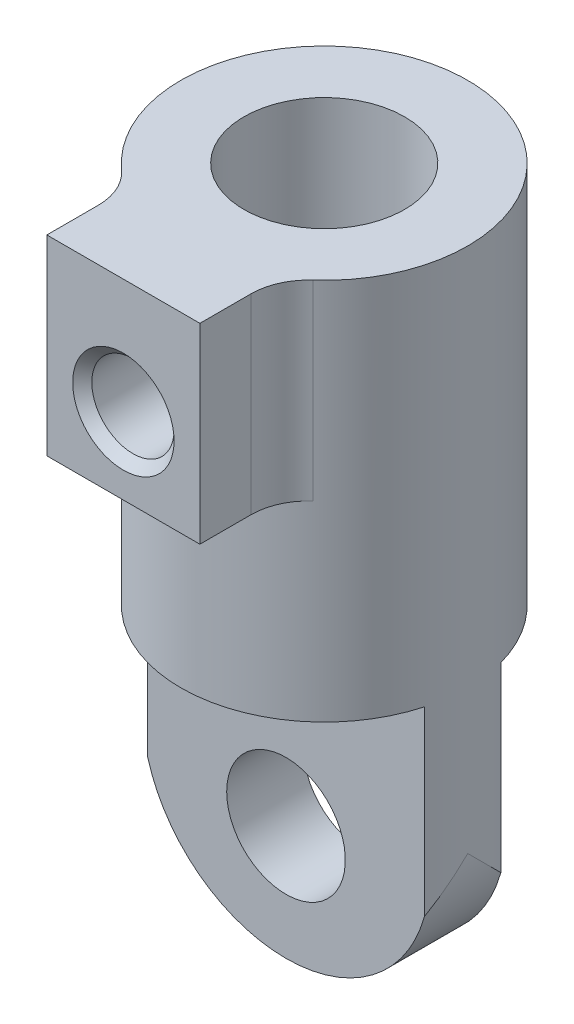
ISO-10303-21;
HEADER;
FILE_DESCRIPTION(('STEP AP214'),'2;1');
FILE_NAME('part.step','',(''),(''),'','','');
FILE_SCHEMA(('AUTOMOTIVE_DESIGN { 1 0 10303 214 1 1 1 1 }'));
ENDSEC;
DATA;
#1=APPLICATION_CONTEXT('core data for automotive mechanical design processes');
#2=APPLICATION_PROTOCOL_DEFINITION('international standard','automotive_design',2000,#1);
#3=PRODUCT_CONTEXT('',#1,'mechanical');
#4=PRODUCT('Part','Part','',(#3));
#5=PRODUCT_RELATED_PRODUCT_CATEGORY('part','',(#4));
#6=PRODUCT_DEFINITION_FORMATION('','',#4);
#7=PRODUCT_DEFINITION_CONTEXT('part definition',#1,'design');
#8=PRODUCT_DEFINITION('design','',#6,#7);
#9=PRODUCT_DEFINITION_SHAPE('','',#8);
#10=(LENGTH_UNIT() NAMED_UNIT(*) SI_UNIT(.MILLI.,.METRE.));
#11=(NAMED_UNIT(*) PLANE_ANGLE_UNIT() SI_UNIT($,.RADIAN.));
#12=(NAMED_UNIT(*) SI_UNIT($,.STERADIAN.) SOLID_ANGLE_UNIT());
#13=UNCERTAINTY_MEASURE_WITH_UNIT(LENGTH_MEASURE(1.E-05),#10,'distance_accuracy_value','');
#14=(GEOMETRIC_REPRESENTATION_CONTEXT(3) GLOBAL_UNCERTAINTY_ASSIGNED_CONTEXT((#13)) GLOBAL_UNIT_ASSIGNED_CONTEXT((#10,
#11,#12)) REPRESENTATION_CONTEXT('',''));
#15=CARTESIAN_POINT('',(0.,0.,0.));
#16=DIRECTION('',(0.,0.,1.));
#17=DIRECTION('',(1.,0.,0.));
#18=AXIS2_PLACEMENT_3D('',#15,#16,#17);
#19=CARTESIAN_POINT('',(0.,19.6,0.));
#20=DIRECTION('',(0.,1.,0.));
#21=DIRECTION('',(0.,0.,1.));
#22=AXIS2_PLACEMENT_3D('',#19,#20,#21);
#23=PLANE('',#22);
#24=DIRECTION('',(1.,0.,0.));
#25=VECTOR('',#24,1.);
#26=CARTESIAN_POINT('',(-2.,19.6,0.));
#27=LINE('',#26,#25);
#28=CARTESIAN_POINT('',(-1.99999999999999,19.6,0.));
#29=VERTEX_POINT('',#28);
#30=CARTESIAN_POINT('',(0.4344315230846,19.6,0.));
#31=VERTEX_POINT('',#30);
#32=EDGE_CURVE('E408',#29,#31,#27,.T.);
#33=ORIENTED_EDGE('',*,*,#32,.T.);
#34=DIRECTION('',(0.258819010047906,0.,-0.965925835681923));
#35=VECTOR('',#34,1.);
#36=CARTESIAN_POINT('',(0.4344315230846,19.6,0.));
#37=LINE('',#36,#35);
#38=CARTESIAN_POINT('',(0.539492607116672,19.6,-0.392093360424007));
#39=VERTEX_POINT('',#38);
#40=EDGE_CURVE('E403',#31,#39,#37,.T.);
#41=ORIENTED_EDGE('',*,*,#40,.T.);
#42=DIRECTION('',(-1.,0.,0.));
#43=VECTOR('',#42,1.);
#44=CARTESIAN_POINT('',(0.5394926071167,19.6,-0.392093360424));
#45=LINE('',#44,#43);
#46=CARTESIAN_POINT('',(-1.489200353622,19.6,-0.392093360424));
#47=VERTEX_POINT('',#46);
#48=EDGE_CURVE('E398',#39,#47,#45,.T.);
#49=ORIENTED_EDGE('',*,*,#48,.T.);
#50=DIRECTION('',(0.2588190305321,0.,-0.965925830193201));
#51=VECTOR('',#50,1.);
#52=CARTESIAN_POINT('',(-1.489200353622,19.6,-0.392093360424));
#53=LINE('',#52,#51);
#54=CARTESIAN_POINT('',(-1.2090374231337,19.6,-1.43767571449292));
#55=VERTEX_POINT('',#54);
#56=EDGE_CURVE('E453',#47,#55,#53,.T.);
#57=ORIENTED_EDGE('',*,*,#56,.T.);
#58=DIRECTION('',(1.,0.,0.));
#59=VECTOR('',#58,1.);
#60=CARTESIAN_POINT('',(-1.209037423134,19.6,-1.437675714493));
#61=LINE('',#60,#59);
#62=CARTESIAN_POINT('',(0.5491631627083,19.6,-1.437675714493));
#63=VERTEX_POINT('',#62);
#64=EDGE_CURVE('E448',#55,#63,#61,.T.);
#65=ORIENTED_EDGE('',*,*,#64,.T.);
#66=DIRECTION('',(0.258819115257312,0.,-0.965925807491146));
#67=VECTOR('',#66,1.);
#68=CARTESIAN_POINT('',(0.5491631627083,19.6,-1.437675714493));
#69=LINE('',#68,#67);
#70=CARTESIAN_POINT('',(0.654224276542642,19.6,-1.82976901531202));
#71=VERTEX_POINT('',#70);
#72=EDGE_CURVE('E443',#63,#71,#69,.T.);
#73=ORIENTED_EDGE('',*,*,#72,.T.);
#74=DIRECTION('',(-1.,0.,0.));
#75=VECTOR('',#74,1.);
#76=CARTESIAN_POINT('',(0.6542242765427,19.6,-1.829769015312));
#77=LINE('',#76,#75);
#78=CARTESIAN_POINT('',(-1.103976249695,19.6,-1.829769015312));
#79=VERTEX_POINT('',#78);
#80=EDGE_CURVE('E438',#71,#79,#77,.T.);
#81=ORIENTED_EDGE('',*,*,#80,.T.);
#82=DIRECTION('',(0.258819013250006,0.,-0.965925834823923));
#83=VECTOR('',#82,1.);
#84=CARTESIAN_POINT('',(-1.103976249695,19.6,-1.829769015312));
#85=LINE('',#84,#83);
#86=CARTESIAN_POINT('',(-0.876343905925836,19.6,-2.67930459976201));
#87=VERTEX_POINT('',#86);
#88=EDGE_CURVE('E433',#79,#87,#85,.T.);
#89=ORIENTED_EDGE('',*,*,#88,.T.);
#90=DIRECTION('',(1.,0.,0.));
#91=VECTOR('',#90,1.);
#92=CARTESIAN_POINT('',(-0.8763439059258,19.6,-2.679304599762));
#93=LINE('',#92,#91);
#94=CARTESIAN_POINT('',(1.152348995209,19.6,-2.679304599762));
#95=VERTEX_POINT('',#94);
#96=EDGE_CURVE('E428',#87,#95,#93,.T.);
#97=ORIENTED_EDGE('',*,*,#96,.T.);
#98=DIRECTION('',(0.258819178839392,0.,-0.965925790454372));
#99=VECTOR('',#98,1.);
#100=CARTESIAN_POINT('',(1.152348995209,19.6,-2.679304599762));
#101=LINE('',#100,#99);
#102=CARTESIAN_POINT('',(1.25741016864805,19.6,-3.07139801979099));
#103=VERTEX_POINT('',#102);
#104=EDGE_CURVE('E423',#95,#103,#101,.T.);
#105=ORIENTED_EDGE('',*,*,#104,.T.);
#106=DIRECTION('',(-1.,0.,0.));
#107=VECTOR('',#106,1.);
#108=CARTESIAN_POINT('',(1.257410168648,19.6,-3.071398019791));
#109=LINE('',#108,#107);
#110=CARTESIAN_POINT('',(-1.177021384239,19.6,-3.071398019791));
#111=VERTEX_POINT('',#110);
#112=EDGE_CURVE('E418',#103,#111,#109,.T.);
#113=ORIENTED_EDGE('',*,*,#112,.T.);
#114=DIRECTION('',(-0.258819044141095,0.,0.965925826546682));
#115=VECTOR('',#114,1.);
#116=CARTESIAN_POINT('',(-1.177021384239,19.6,-3.071398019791));
#117=LINE('',#116,#115);
#118=EDGE_CURVE('E413',#111,#29,#117,.T.);
#119=ORIENTED_EDGE('',*,*,#118,.T.);
#120=EDGE_LOOP('',(#33,#41,#49,#57,#65,#73,#81,#89,#97,#105,#113,#119));
#121=FACE_BOUND('',#120,.T.);
#122=ADVANCED_FACE('F16',(#121),#23,.T.);
#123=CARTESIAN_POINT('',(-1.489200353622,20.,-0.392093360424));
#124=DIRECTION('',(0.965925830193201,0.,0.2588190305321));
#125=DIRECTION('',(0.2588190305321,0.,-0.965925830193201));
#126=AXIS2_PLACEMENT_3D('',#123,#124,#125);
#127=PLANE('',#126);
#128=DIRECTION('',(0.,1.,0.));
#129=VECTOR('',#128,1.);
#130=CARTESIAN_POINT('',(-1.209037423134,20.,-1.437675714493));
#131=LINE('',#130,#129);
#132=CARTESIAN_POINT('',(-1.2090374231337,20.,-1.43767571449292));
#133=VERTEX_POINT('',#132);
#134=EDGE_CURVE('E450',#133,#55,#131,.F.);
#135=ORIENTED_EDGE('',*,*,#134,.T.);
#136=ORIENTED_EDGE('',*,*,#56,.F.);
#137=DIRECTION('',(0.,1.,0.));
#138=VECTOR('',#137,1.);
#139=CARTESIAN_POINT('',(-1.489200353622,20.,-0.392093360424));
#140=LINE('',#139,#138);
#141=CARTESIAN_POINT('',(-1.489200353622,20.,-0.392093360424));
#142=VERTEX_POINT('',#141);
#143=EDGE_CURVE('E396',#47,#142,#140,.T.);
#144=ORIENTED_EDGE('',*,*,#143,.T.);
#145=DIRECTION('',(0.258819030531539,0.,-0.965925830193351));
#146=VECTOR('',#145,1.);
#147=CARTESIAN_POINT('',(-1.489200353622,20.,-0.392093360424));
#148=LINE('',#147,#146);
#149=EDGE_CURVE('E394',#142,#133,#148,.T.);
#150=ORIENTED_EDGE('',*,*,#149,.T.);
#151=EDGE_LOOP('',(#135,#136,#144,#150));
#152=FACE_BOUND('',#151,.T.);
#153=ADVANCED_FACE('F461',(#152),#127,.F.);
#154=CARTESIAN_POINT('',(-1.209037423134,20.,-1.437675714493));
#155=DIRECTION('',(0.,0.,1.));
#156=DIRECTION('',(1.,0.,0.));
#157=AXIS2_PLACEMENT_3D('',#154,#155,#156);
#158=PLANE('',#157);
#159=DIRECTION('',(0.,1.,0.));
#160=VECTOR('',#159,1.);
#161=CARTESIAN_POINT('',(0.5491631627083,20.,-1.437675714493));
#162=LINE('',#161,#160);
#163=CARTESIAN_POINT('',(0.5491631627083,20.,-1.437675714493));
#164=VERTEX_POINT('',#163);
#165=EDGE_CURVE('E445',#164,#63,#162,.F.);
#166=ORIENTED_EDGE('',*,*,#165,.T.);
#167=ORIENTED_EDGE('',*,*,#64,.F.);
#168=ORIENTED_EDGE('',*,*,#134,.F.);
#169=DIRECTION('',(1.,0.,0.));
#170=VECTOR('',#169,1.);
#171=CARTESIAN_POINT('',(0.,20.,-1.437675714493));
#172=LINE('',#171,#170);
#173=EDGE_CURVE('E392',#133,#164,#172,.T.);
#174=ORIENTED_EDGE('',*,*,#173,.T.);
#175=EDGE_LOOP('',(#166,#167,#168,#174));
#176=FACE_BOUND('',#175,.T.);
#177=ADVANCED_FACE('F465',(#176),#158,.F.);
#178=CARTESIAN_POINT('',(0.5491631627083,20.,-1.437675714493));
#179=DIRECTION('',(0.965925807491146,0.,0.258819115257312));
#180=DIRECTION('',(0.258819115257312,0.,-0.965925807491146));
#181=AXIS2_PLACEMENT_3D('',#178,#179,#180);
#182=PLANE('',#181);
#183=DIRECTION('',(0.,1.,0.));
#184=VECTOR('',#183,1.);
#185=CARTESIAN_POINT('',(0.6542242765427,20.,-1.829769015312));
#186=LINE('',#185,#184);
#187=CARTESIAN_POINT('',(0.654224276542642,20.,-1.82976901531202));
#188=VERTEX_POINT('',#187);
#189=EDGE_CURVE('E440',#188,#71,#186,.F.);
#190=ORIENTED_EDGE('',*,*,#189,.T.);
#191=ORIENTED_EDGE('',*,*,#72,.F.);
#192=ORIENTED_EDGE('',*,*,#165,.F.);
#193=DIRECTION('',(0.258819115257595,0.,-0.96592580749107));
#194=VECTOR('',#193,1.);
#195=CARTESIAN_POINT('',(0.5491631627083,20.,-1.437675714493));
#196=LINE('',#195,#194);
#197=EDGE_CURVE('E390',#164,#188,#196,.T.);
#198=ORIENTED_EDGE('',*,*,#197,.T.);
#199=EDGE_LOOP('',(#190,#191,#192,#198));
#200=FACE_BOUND('',#199,.T.);
#201=ADVANCED_FACE('F470',(#200),#182,.F.);
#202=CARTESIAN_POINT('',(0.6542242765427,20.,-1.829769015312));
#203=DIRECTION('',(0.,0.,-1.));
#204=DIRECTION('',(-1.,0.,0.));
#205=AXIS2_PLACEMENT_3D('',#202,#203,#204);
#206=PLANE('',#205);
#207=DIRECTION('',(0.,1.,0.));
#208=VECTOR('',#207,1.);
#209=CARTESIAN_POINT('',(-1.103976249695,20.,-1.829769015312));
#210=LINE('',#209,#208);
#211=CARTESIAN_POINT('',(-1.103976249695,20.,-1.829769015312));
#212=VERTEX_POINT('',#211);
#213=EDGE_CURVE('E435',#212,#79,#210,.F.);
#214=ORIENTED_EDGE('',*,*,#213,.T.);
#215=ORIENTED_EDGE('',*,*,#80,.F.);
#216=ORIENTED_EDGE('',*,*,#189,.F.);
#217=DIRECTION('',(1.,0.,0.));
#218=VECTOR('',#217,1.);
#219=CARTESIAN_POINT('',(0.,20.,-1.829769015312));
#220=LINE('',#219,#218);
#221=EDGE_CURVE('E388',#188,#212,#220,.F.);
#222=ORIENTED_EDGE('',*,*,#221,.T.);
#223=EDGE_LOOP('',(#214,#215,#216,#222));
#224=FACE_BOUND('',#223,.T.);
#225=ADVANCED_FACE('F476',(#224),#206,.F.);
#226=CARTESIAN_POINT('',(-1.103976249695,20.,-1.829769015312));
#227=DIRECTION('',(0.965925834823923,0.,0.258819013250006));
#228=DIRECTION('',(0.258819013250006,0.,-0.965925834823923));
#229=AXIS2_PLACEMENT_3D('',#226,#227,#228);
#230=PLANE('',#229);
#231=DIRECTION('',(0.,1.,0.));
#232=VECTOR('',#231,1.);
#233=CARTESIAN_POINT('',(-0.8763439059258,20.,-2.679304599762));
#234=LINE('',#233,#232);
#235=CARTESIAN_POINT('',(-0.876343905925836,20.,-2.67930459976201));
#236=VERTEX_POINT('',#235);
#237=EDGE_CURVE('E430',#236,#87,#234,.F.);
#238=ORIENTED_EDGE('',*,*,#237,.T.);
#239=ORIENTED_EDGE('',*,*,#88,.F.);
#240=ORIENTED_EDGE('',*,*,#213,.F.);
#241=DIRECTION('',(0.258819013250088,0.,-0.965925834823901));
#242=VECTOR('',#241,1.);
#243=CARTESIAN_POINT('',(-1.103976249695,20.,-1.829769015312));
#244=LINE('',#243,#242);
#245=EDGE_CURVE('E386',#212,#236,#244,.T.);
#246=ORIENTED_EDGE('',*,*,#245,.T.);
#247=EDGE_LOOP('',(#238,#239,#240,#246));
#248=FACE_BOUND('',#247,.T.);
#249=ADVANCED_FACE('F480',(#248),#230,.F.);
#250=CARTESIAN_POINT('',(-0.8763439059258,20.,-2.679304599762));
#251=DIRECTION('',(0.,0.,1.));
#252=DIRECTION('',(1.,0.,0.));
#253=AXIS2_PLACEMENT_3D('',#250,#251,#252);
#254=PLANE('',#253);
#255=DIRECTION('',(0.,1.,0.));
#256=VECTOR('',#255,1.);
#257=CARTESIAN_POINT('',(1.152348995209,20.,-2.679304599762));
#258=LINE('',#257,#256);
#259=CARTESIAN_POINT('',(1.152348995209,20.,-2.679304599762));
#260=VERTEX_POINT('',#259);
#261=EDGE_CURVE('E425',#260,#95,#258,.F.);
#262=ORIENTED_EDGE('',*,*,#261,.T.);
#263=ORIENTED_EDGE('',*,*,#96,.F.);
#264=ORIENTED_EDGE('',*,*,#237,.F.);
#265=DIRECTION('',(1.,0.,0.));
#266=VECTOR('',#265,1.);
#267=CARTESIAN_POINT('',(0.,20.,-2.679304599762));
#268=LINE('',#267,#266);
#269=EDGE_CURVE('E384',#236,#260,#268,.T.);
#270=ORIENTED_EDGE('',*,*,#269,.T.);
#271=EDGE_LOOP('',(#262,#263,#264,#270));
#272=FACE_BOUND('',#271,.T.);
#273=ADVANCED_FACE('F485',(#272),#254,.F.);
#274=CARTESIAN_POINT('',(1.152348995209,20.,-2.679304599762));
#275=DIRECTION('',(0.965925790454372,0.,0.258819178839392));
#276=DIRECTION('',(0.258819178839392,0.,-0.965925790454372));
#277=AXIS2_PLACEMENT_3D('',#274,#275,#276);
#278=PLANE('',#277);
#279=DIRECTION('',(0.,1.,0.));
#280=VECTOR('',#279,1.);
#281=CARTESIAN_POINT('',(1.257410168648,20.,-3.071398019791));
#282=LINE('',#281,#280);
#283=CARTESIAN_POINT('',(1.25741016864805,20.,-3.07139801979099));
#284=VERTEX_POINT('',#283);
#285=EDGE_CURVE('E420',#284,#103,#282,.F.);
#286=ORIENTED_EDGE('',*,*,#285,.T.);
#287=ORIENTED_EDGE('',*,*,#104,.F.);
#288=ORIENTED_EDGE('',*,*,#261,.F.);
#289=DIRECTION('',(0.258819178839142,0.,-0.965925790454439));
#290=VECTOR('',#289,1.);
#291=CARTESIAN_POINT('',(1.152348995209,20.,-2.679304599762));
#292=LINE('',#291,#290);
#293=EDGE_CURVE('E382',#260,#284,#292,.T.);
#294=ORIENTED_EDGE('',*,*,#293,.T.);
#295=EDGE_LOOP('',(#286,#287,#288,#294));
#296=FACE_BOUND('',#295,.T.);
#297=ADVANCED_FACE('F491',(#296),#278,.F.);
#298=CARTESIAN_POINT('',(1.257410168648,20.,-3.071398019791));
#299=DIRECTION('',(0.,0.,-1.));
#300=DIRECTION('',(-1.,0.,0.));
#301=AXIS2_PLACEMENT_3D('',#298,#299,#300);
#302=PLANE('',#301);
#303=DIRECTION('',(0.,1.,0.));
#304=VECTOR('',#303,1.);
#305=CARTESIAN_POINT('',(-1.177021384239,20.,-3.071398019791));
#306=LINE('',#305,#304);
#307=CARTESIAN_POINT('',(-1.177021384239,20.,-3.071398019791));
#308=VERTEX_POINT('',#307);
#309=EDGE_CURVE('E415',#308,#111,#306,.F.);
#310=ORIENTED_EDGE('',*,*,#309,.T.);
#311=ORIENTED_EDGE('',*,*,#112,.F.);
#312=ORIENTED_EDGE('',*,*,#285,.F.);
#313=DIRECTION('',(1.,0.,0.));
#314=VECTOR('',#313,1.);
#315=CARTESIAN_POINT('',(0.,20.,-3.071398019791));
#316=LINE('',#315,#314);
#317=EDGE_CURVE('E380',#284,#308,#316,.F.);
#318=ORIENTED_EDGE('',*,*,#317,.T.);
#319=EDGE_LOOP('',(#310,#311,#312,#318));
#320=FACE_BOUND('',#319,.T.);
#321=ADVANCED_FACE('F495',(#320),#302,.F.);
#322=CARTESIAN_POINT('',(-1.177021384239,20.,-3.071398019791));
#323=DIRECTION('',(-0.965925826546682,0.,-0.258819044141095));
#324=DIRECTION('',(-0.258819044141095,0.,0.965925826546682));
#325=AXIS2_PLACEMENT_3D('',#322,#323,#324);
#326=PLANE('',#325);
#327=DIRECTION('',(0.,1.,0.));
#328=VECTOR('',#327,1.);
#329=CARTESIAN_POINT('',(-2.,20.,0.));
#330=LINE('',#329,#328);
#331=CARTESIAN_POINT('',(-1.99999999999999,20.,0.));
#332=VERTEX_POINT('',#331);
#333=EDGE_CURVE('E410',#332,#29,#330,.F.);
#334=ORIENTED_EDGE('',*,*,#333,.T.);
#335=ORIENTED_EDGE('',*,*,#118,.F.);
#336=ORIENTED_EDGE('',*,*,#309,.F.);
#337=DIRECTION('',(-0.258819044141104,0.,0.965925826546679));
#338=VECTOR('',#337,1.);
#339=CARTESIAN_POINT('',(-1.177021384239,20.,-3.071398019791));
#340=LINE('',#339,#338);
#341=EDGE_CURVE('E378',#308,#332,#340,.T.);
#342=ORIENTED_EDGE('',*,*,#341,.T.);
#343=EDGE_LOOP('',(#334,#335,#336,#342));
#344=FACE_BOUND('',#343,.T.);
#345=ADVANCED_FACE('F500',(#344),#326,.F.);
#346=CARTESIAN_POINT('',(-2.,20.,0.));
#347=DIRECTION('',(0.,0.,1.));
#348=DIRECTION('',(1.,0.,0.));
#349=AXIS2_PLACEMENT_3D('',#346,#347,#348);
#350=PLANE('',#349);
#351=DIRECTION('',(0.,1.,0.));
#352=VECTOR('',#351,1.);
#353=CARTESIAN_POINT('',(0.4344315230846,20.,0.));
#354=LINE('',#353,#352);
#355=CARTESIAN_POINT('',(0.4344315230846,20.,0.));
#356=VERTEX_POINT('',#355);
#357=EDGE_CURVE('E405',#356,#31,#354,.F.);
#358=ORIENTED_EDGE('',*,*,#357,.T.);
#359=ORIENTED_EDGE('',*,*,#32,.F.);
#360=ORIENTED_EDGE('',*,*,#333,.F.);
#361=DIRECTION('',(1.,0.,0.));
#362=VECTOR('',#361,1.);
#363=CARTESIAN_POINT('',(0.,20.,0.));
#364=LINE('',#363,#362);
#365=EDGE_CURVE('E376',#332,#356,#364,.T.);
#366=ORIENTED_EDGE('',*,*,#365,.T.);
#367=EDGE_LOOP('',(#358,#359,#360,#366));
#368=FACE_BOUND('',#367,.T.);
#369=ADVANCED_FACE('F506',(#368),#350,.F.);
#370=CARTESIAN_POINT('',(0.4344315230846,20.,0.));
#371=DIRECTION('',(0.965925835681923,0.,0.258819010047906));
#372=DIRECTION('',(0.258819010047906,0.,-0.965925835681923));
#373=AXIS2_PLACEMENT_3D('',#370,#371,#372);
#374=PLANE('',#373);
#375=DIRECTION('',(0.,1.,0.));
#376=VECTOR('',#375,1.);
#377=CARTESIAN_POINT('',(0.5394926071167,20.,-0.392093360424));
#378=LINE('',#377,#376);
#379=CARTESIAN_POINT('',(0.539492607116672,20.,-0.392093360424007));
#380=VERTEX_POINT('',#379);
#381=EDGE_CURVE('E400',#380,#39,#378,.F.);
#382=ORIENTED_EDGE('',*,*,#381,.T.);
#383=ORIENTED_EDGE('',*,*,#40,.F.);
#384=ORIENTED_EDGE('',*,*,#357,.F.);
#385=DIRECTION('',(0.258819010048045,0.,-0.965925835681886));
#386=VECTOR('',#385,1.);
#387=CARTESIAN_POINT('',(0.4344315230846,20.,0.));
#388=LINE('',#387,#386);
#389=EDGE_CURVE('E374',#356,#380,#388,.T.);
#390=ORIENTED_EDGE('',*,*,#389,.T.);
#391=EDGE_LOOP('',(#382,#383,#384,#390));
#392=FACE_BOUND('',#391,.T.);
#393=ADVANCED_FACE('F510',(#392),#374,.F.);
#394=CARTESIAN_POINT('',(0.5394926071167,20.,-0.392093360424));
#395=DIRECTION('',(0.,0.,-1.));
#396=DIRECTION('',(-1.,0.,0.));
#397=AXIS2_PLACEMENT_3D('',#394,#395,#396);
#398=PLANE('',#397);
#399=ORIENTED_EDGE('',*,*,#143,.F.);
#400=ORIENTED_EDGE('',*,*,#48,.F.);
#401=ORIENTED_EDGE('',*,*,#381,.F.);
#402=DIRECTION('',(1.,0.,0.));
#403=VECTOR('',#402,1.);
#404=CARTESIAN_POINT('',(0.,20.,-0.392093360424));
#405=LINE('',#404,#403);
#406=EDGE_CURVE('E369',#380,#142,#405,.F.);
#407=ORIENTED_EDGE('',*,*,#406,.T.);
#408=EDGE_LOOP('',(#399,#400,#401,#407));
#409=FACE_BOUND('',#408,.T.);
#410=ADVANCED_FACE('F514',(#409),#398,.F.);
#411=CARTESIAN_POINT('',(0.,20.,0.));
#412=DIRECTION('',(0.,-1.,0.));
#413=DIRECTION('',(0.,0.,-1.));
#414=AXIS2_PLACEMENT_3D('',#411,#412,#413);
#415=PLANE('',#414);
#416=ORIENTED_EDGE('',*,*,#389,.F.);
#417=ORIENTED_EDGE('',*,*,#365,.F.);
#418=ORIENTED_EDGE('',*,*,#341,.F.);
#419=ORIENTED_EDGE('',*,*,#317,.F.);
#420=ORIENTED_EDGE('',*,*,#293,.F.);
#421=ORIENTED_EDGE('',*,*,#269,.F.);
#422=ORIENTED_EDGE('',*,*,#245,.F.);
#423=ORIENTED_EDGE('',*,*,#221,.F.);
#424=ORIENTED_EDGE('',*,*,#197,.F.);
#425=ORIENTED_EDGE('',*,*,#173,.F.);
#426=ORIENTED_EDGE('',*,*,#149,.F.);
#427=ORIENTED_EDGE('',*,*,#406,.F.);
#428=EDGE_LOOP('',(#416,#417,#418,#419,#420,#421,#422,#423,#424,#425,#426,#427));
#429=FACE_BOUND('',#428,.T.);
#430=CARTESIAN_POINT('',(0.,20.,0.));
#431=DIRECTION('',(0.,-1.,0.));
#432=DIRECTION('',(0.,0.,-1.));
#433=AXIS2_PLACEMENT_3D('',#430,#431,#432);
#434=CIRCLE('',#433,4.2);
#435=CARTESIAN_POINT('',(0.,20.,-4.2));
#436=VERTEX_POINT('',#435);
#437=EDGE_CURVE('E19',#436,#436,#434,.F.);
#438=ORIENTED_EDGE('',*,*,#437,.T.);
#439=EDGE_LOOP('',(#438));
#440=FACE_BOUND('',#439,.T.);
#441=ADVANCED_FACE('F225',(#429,#440),#415,.F.);
#442=CARTESIAN_POINT('',(0.,29.,10.5));
#443=DIRECTION('',(0.,0.,-1.));
#444=DIRECTION('',(-1.,0.,0.));
#445=AXIS2_PLACEMENT_3D('',#442,#443,#444);
#446=CYLINDRICAL_SURFACE('',#445,2.15);
#447=CARTESIAN_POINT('',(0.,29.,9.99999999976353));
#448=DIRECTION('',(0.,0.,1.));
#449=DIRECTION('',(1.,0.,0.));
#450=AXIS2_PLACEMENT_3D('',#447,#448,#449);
#451=CIRCLE('',#450,2.15000000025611);
#452=CARTESIAN_POINT('',(2.15000000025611,29.,9.99999999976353));
#453=VERTEX_POINT('',#452);
#454=EDGE_CURVE('E366',#453,#453,#451,.T.);
#455=ORIENTED_EDGE('',*,*,#454,.T.);
#456=EDGE_LOOP('',(#455));
#457=FACE_BOUND('',#456,.T.);
#458=CARTESIAN_POINT('',(-2.15,29.,3.60797727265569));
#459=CARTESIAN_POINT('',(-2.14999364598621,29.1116960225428,3.60798558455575));
#460=CARTESIAN_POINT('',(-2.14124392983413,29.2234528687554,3.61323942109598));
#461=CARTESIAN_POINT('',(-2.10672513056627,29.4434496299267,3.63346733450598));
#462=CARTESIAN_POINT('',(-2.08093536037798,29.5516851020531,3.64845322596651));
#463=CARTESIAN_POINT('',(-2.01376236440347,29.761117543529,3.6859486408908));
#464=CARTESIAN_POINT('',(-1.97246030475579,29.8623479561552,3.70841893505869));
#465=CARTESIAN_POINT('',(-1.87569159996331,30.0564347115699,3.75828896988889));
#466=CARTESIAN_POINT('',(-1.82022129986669,30.1492888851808,3.78568998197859));
#467=CARTESIAN_POINT('',(-1.69106411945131,30.3328394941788,3.8452279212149));
#468=CARTESIAN_POINT('',(-1.61621555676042,30.4226524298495,3.87756948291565));
#469=CARTESIAN_POINT('',(-1.45284016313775,30.5891405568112,3.94169499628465));
#470=CARTESIAN_POINT('',(-1.36430666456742,30.6658093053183,3.97347866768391));
#471=CARTESIAN_POINT('',(-1.16834231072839,30.8092097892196,4.03562472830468));
#472=CARTESIAN_POINT('',(-1.06001282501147,30.8748388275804,4.06572293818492));
#473=CARTESIAN_POINT('',(-0.832020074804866,30.9865354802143,4.11842097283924));
#474=CARTESIAN_POINT('',(-0.712364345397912,31.0326159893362,4.1410257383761));
#475=CARTESIAN_POINT('',(-0.474495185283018,31.1003556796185,4.17470930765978));
#476=CARTESIAN_POINT('',(-0.356830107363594,31.123569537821,4.18651717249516));
#477=CARTESIAN_POINT('',(-0.11872955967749,31.1500522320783,4.20001029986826));
#478=CARTESIAN_POINT('',(0.00170410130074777,31.1533337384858,4.20170199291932));
#479=CARTESIAN_POINT('',(0.230170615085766,31.1404233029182,4.19510376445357));
#480=CARTESIAN_POINT('',(0.338334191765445,31.1259771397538,4.18770860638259));
#481=CARTESIAN_POINT('',(0.550450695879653,31.081166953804,4.16513889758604));
#482=CARTESIAN_POINT('',(0.654403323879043,31.050801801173,4.14996379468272));
#483=CARTESIAN_POINT('',(0.85690739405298,30.9748586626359,4.11296196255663));
#484=CARTESIAN_POINT('',(0.955368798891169,30.9290840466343,4.09104959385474));
#485=CARTESIAN_POINT('',(1.14344077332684,30.8239145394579,4.04252270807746));
#486=CARTESIAN_POINT('',(1.23304833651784,30.7645150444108,4.01590660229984));
#487=CARTESIAN_POINT('',(1.41022162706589,30.6271266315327,3.95737371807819));
#488=CARTESIAN_POINT('',(1.49673187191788,30.5478882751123,3.92519311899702));
#489=CARTESIAN_POINT('',(1.65583481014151,30.3763763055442,3.86077652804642));
#490=CARTESIAN_POINT('',(1.72841356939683,30.2840898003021,3.82854051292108));
#491=CARTESIAN_POINT('',(1.86253088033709,30.0813244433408,3.765216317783));
#492=CARTESIAN_POINT('',(1.92295317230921,29.9700273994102,3.73436319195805));
#493=CARTESIAN_POINT('',(2.02370237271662,29.7369905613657,3.68075041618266));
#494=CARTESIAN_POINT('',(2.06407333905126,29.6152743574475,3.65797305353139));
#495=CARTESIAN_POINT('',(2.11206482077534,29.4103974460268,3.63037632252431));
#496=CARTESIAN_POINT('',(2.12624856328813,29.3292010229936,3.62204185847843));
#497=CARTESIAN_POINT('',(2.14521745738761,29.1653472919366,3.61083986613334));
#498=CARTESIAN_POINT('',(2.15000470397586,29.0826903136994,3.60797111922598));
#499=CARTESIAN_POINT('',(2.14999364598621,28.8883039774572,3.60798558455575));
#500=CARTESIAN_POINT('',(2.14124392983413,28.7765471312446,3.61323942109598));
#501=CARTESIAN_POINT('',(2.10672513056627,28.5565503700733,3.63346733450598));
#502=CARTESIAN_POINT('',(2.08093536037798,28.4483148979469,3.64845322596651));
#503=CARTESIAN_POINT('',(2.01376236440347,28.238882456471,3.6859486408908));
#504=CARTESIAN_POINT('',(1.97246030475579,28.1376520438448,3.70841893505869));
#505=CARTESIAN_POINT('',(1.87569159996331,27.9435652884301,3.7582889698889));
#506=CARTESIAN_POINT('',(1.82022129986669,27.8507111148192,3.78568998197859));
#507=CARTESIAN_POINT('',(1.69106411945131,27.6671605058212,3.8452279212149));
#508=CARTESIAN_POINT('',(1.61621555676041,27.5773475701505,3.87756948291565));
#509=CARTESIAN_POINT('',(1.45284016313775,27.4108594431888,3.94169499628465));
#510=CARTESIAN_POINT('',(1.36430666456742,27.3341906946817,3.97347866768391));
#511=CARTESIAN_POINT('',(1.16834231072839,27.1907902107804,4.03562472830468));
#512=CARTESIAN_POINT('',(1.06001282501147,27.1251611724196,4.06572293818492));
#513=CARTESIAN_POINT('',(0.832020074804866,27.0134645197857,4.11842097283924));
#514=CARTESIAN_POINT('',(0.712364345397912,26.9673840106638,4.1410257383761));
#515=CARTESIAN_POINT('',(0.474495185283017,26.8996443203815,4.17470930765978));
#516=CARTESIAN_POINT('',(0.356830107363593,26.876430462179,4.18651717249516));
#517=CARTESIAN_POINT('',(0.11872955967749,26.8499477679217,4.20001029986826));
#518=CARTESIAN_POINT('',(-0.0017041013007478,26.8466662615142,4.20170199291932));
#519=CARTESIAN_POINT('',(-0.230170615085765,26.8595766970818,4.19510376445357));
#520=CARTESIAN_POINT('',(-0.338334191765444,26.8740228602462,4.18770860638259));
#521=CARTESIAN_POINT('',(-0.550450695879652,26.918833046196,4.16513889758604));
#522=CARTESIAN_POINT('',(-0.654403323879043,26.9491981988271,4.14996379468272));
#523=CARTESIAN_POINT('',(-0.85690739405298,27.0251413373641,4.11296196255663));
#524=CARTESIAN_POINT('',(-0.955368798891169,27.0709159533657,4.09104959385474));
#525=CARTESIAN_POINT('',(-1.14344077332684,27.1760854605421,4.04252270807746));
#526=CARTESIAN_POINT('',(-1.23304833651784,27.2354849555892,4.01590660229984));
#527=CARTESIAN_POINT('',(-1.41022162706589,27.3728733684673,3.95737371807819));
#528=CARTESIAN_POINT('',(-1.49673187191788,27.4521117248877,3.92519311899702));
#529=CARTESIAN_POINT('',(-1.65583481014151,27.6236236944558,3.86077652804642));
#530=CARTESIAN_POINT('',(-1.72841356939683,27.7159101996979,3.82854051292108));
#531=CARTESIAN_POINT('',(-1.86253088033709,27.9186755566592,3.765216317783));
#532=CARTESIAN_POINT('',(-1.92295317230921,28.0299726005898,3.73436319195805));
#533=CARTESIAN_POINT('',(-2.02370237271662,28.2630094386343,3.68075041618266));
#534=CARTESIAN_POINT('',(-2.06407333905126,28.3847256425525,3.65797305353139));
#535=CARTESIAN_POINT('',(-2.11206482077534,28.5896025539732,3.63037632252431));
#536=CARTESIAN_POINT('',(-2.12624856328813,28.6707989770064,3.62204185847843));
#537=CARTESIAN_POINT('',(-2.14521745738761,28.8346527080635,3.61083986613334));
#538=CARTESIAN_POINT('',(-2.15000470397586,28.9173096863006,3.60797111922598));
#539=CARTESIAN_POINT('',(-2.15,29.,3.60797727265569));
#540=B_SPLINE_CURVE_WITH_KNOTS('',3,(#458,#459,#460,#461,#462,#463,#464,#465,#466,#467,#468,
#469,#470,#471,#472,#473,#474,#475,#476,#477,#478,#479,#480,#481,#482,#483,#484,#485,#486,#487,
#488,#489,#490,#491,#492,#493,#494,#495,#496,#497,#498,#499,#500,#501,#502,#503,#504,#505,#506,
#507,#508,#509,#510,#511,#512,#513,#514,#515,#516,#517,#518,#519,#520,#521,#522,#523,#524,#525,
#526,#527,#528,#529,#530,#531,#532,#533,#534,#535,#536,#537,#538,#539),.UNSPECIFIED.,.T.,.F.,(4,
2,2,2,2,2,2,2,2,2,2,2,2,2,2,2,2,2,2,2,2,2,2,2,2,2,2,2,2,2,2,2,2,2,2,2,2,2,2,2,4),(0.,
0.334750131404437,0.669907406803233,1.00333490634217,1.33684850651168,1.69924939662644,
2.06182741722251,2.45033411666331,2.83858414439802,3.19810729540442,3.55740188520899,
3.88398412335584,4.2105895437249,4.54153135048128,4.87258514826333,5.23599416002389,
5.5997647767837,5.9887897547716,6.37695612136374,6.62483215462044,6.87265291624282,
7.20740304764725,7.54256032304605,7.87598782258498,8.2095014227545,8.57190231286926,
8.93448033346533,9.32298703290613,9.71123706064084,10.0707602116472,10.4300548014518,
10.7566370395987,11.0832424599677,11.4141842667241,11.7452380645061,12.1086470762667,
12.4724176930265,12.8614426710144,13.2496090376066,13.4974850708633,13.7453058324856),.UNSPECIFIED.);
#541=CARTESIAN_POINT('',(-2.15,29.,3.60797727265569));
#542=VERTEX_POINT('',#541);
#543=EDGE_CURVE('E201',#542,#542,#540,.T.);
#544=ORIENTED_EDGE('',*,*,#543,.T.);
#545=EDGE_LOOP('',(#544));
#546=FACE_BOUND('',#545,.T.);
#547=ADVANCED_FACE('F207',(#457,#546),#446,.F.);
#548=CARTESIAN_POINT('',(0.,29.,10.5000000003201));
#549=DIRECTION('',(0.,0.,1.));
#550=DIRECTION('',(1.,0.,0.));
#551=AXIS2_PLACEMENT_3D('',#548,#549,#550);
#552=CONICAL_SURFACE('',#551,2.64999999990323,0.785398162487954);
#553=ORIENTED_EDGE('',*,*,#454,.F.);
#554=EDGE_LOOP('',(#553));
#555=FACE_BOUND('',#554,.T.);
#556=CARTESIAN_POINT('',(0.,29.,10.5000000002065));
#557=DIRECTION('',(0.,0.,1.));
#558=DIRECTION('',(1.,0.,0.));
#559=AXIS2_PLACEMENT_3D('',#556,#557,#558);
#560=CIRCLE('',#559,2.64999999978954);
#561=CARTESIAN_POINT('',(2.64999999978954,29.,10.5000000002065));
#562=VERTEX_POINT('',#561);
#563=EDGE_CURVE('E197',#562,#562,#560,.F.);
#564=ORIENTED_EDGE('',*,*,#563,.F.);
#565=EDGE_LOOP('',(#564));
#566=FACE_BOUND('',#565,.T.);
#567=ADVANCED_FACE('F215',(#555,#566),#552,.F.);
#568=CARTESIAN_POINT('',(0.,35.,0.));
#569=DIRECTION('',(0.,-1.,0.));
#570=DIRECTION('',(0.,0.,-1.));
#571=AXIS2_PLACEMENT_3D('',#568,#569,#570);
#572=CYLINDRICAL_SURFACE('',#571,4.2);
#573=ORIENTED_EDGE('',*,*,#543,.F.);
#574=EDGE_LOOP('',(#573));
#575=FACE_BOUND('',#574,.T.);
#576=ORIENTED_EDGE('',*,*,#437,.F.);
#577=EDGE_LOOP('',(#576));
#578=FACE_BOUND('',#577,.T.);
#579=CARTESIAN_POINT('',(0.,35.,0.));
#580=DIRECTION('',(0.,-1.,0.));
#581=DIRECTION('',(0.,0.,-1.));
#582=AXIS2_PLACEMENT_3D('',#579,#580,#581);
#583=CIRCLE('',#582,4.2);
#584=CARTESIAN_POINT('',(0.,35.,-4.2));
#585=VERTEX_POINT('',#584);
#586=EDGE_CURVE('E176',#585,#585,#583,.T.);
#587=ORIENTED_EDGE('',*,*,#586,.F.);
#588=EDGE_LOOP('',(#587));
#589=FACE_BOUND('',#588,.T.);
#590=ADVANCED_FACE('F211',(#575,#578,#589),#572,.F.);
#591=CARTESIAN_POINT('',(4.,0.,0.));
#592=DIRECTION('',(1.,0.,0.));
#593=DIRECTION('',(0.,0.,-1.));
#594=AXIS2_PLACEMENT_3D('',#591,#592,#593);
#595=PLANE('',#594);
#596=DIRECTION('',(0.,1.,0.));
#597=VECTOR('',#596,1.);
#598=CARTESIAN_POINT('',(4.,35.,10.5));
#599=LINE('',#598,#597);
#600=CARTESIAN_POINT('',(4.,25.,10.5));
#601=VERTEX_POINT('',#600);
#602=CARTESIAN_POINT('',(4.,35.,10.5));
#603=VERTEX_POINT('',#602);
#604=EDGE_CURVE('E200',#601,#603,#599,.T.);
#605=ORIENTED_EDGE('',*,*,#604,.F.);
#606=DIRECTION('',(0.,0.,-1.));
#607=VECTOR('',#606,1.);
#608=CARTESIAN_POINT('',(4.,25.,10.5));
#609=LINE('',#608,#607);
#610=CARTESIAN_POINT('',(4.,25.,7.826237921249));
#611=VERTEX_POINT('',#610);
#612=EDGE_CURVE('E182',#611,#601,#609,.F.);
#613=ORIENTED_EDGE('',*,*,#612,.F.);
#614=DIRECTION('',(0.,-1.,0.));
#615=VECTOR('',#614,1.);
#616=CARTESIAN_POINT('',(4.,40.02531031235,7.826237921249));
#617=LINE('',#616,#615);
#618=CARTESIAN_POINT('',(4.,35.,7.826237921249));
#619=VERTEX_POINT('',#618);
#620=EDGE_CURVE('E179',#611,#619,#617,.F.);
#621=ORIENTED_EDGE('',*,*,#620,.T.);
#622=DIRECTION('',(0.,0.,1.));
#623=VECTOR('',#622,1.);
#624=CARTESIAN_POINT('',(4.,35.,0.));
#625=LINE('',#624,#623);
#626=EDGE_CURVE('E166',#603,#619,#625,.F.);
#627=ORIENTED_EDGE('',*,*,#626,.F.);
#628=EDGE_LOOP('',(#605,#613,#621,#627));
#629=FACE_BOUND('',#628,.T.);
#630=ADVANCED_FACE('F180',(#629),#595,.T.);
#631=CARTESIAN_POINT('',(-4.,35.,10.5));
#632=DIRECTION('',(0.,0.,1.));
#633=DIRECTION('',(1.,0.,0.));
#634=AXIS2_PLACEMENT_3D('',#631,#632,#633);
#635=PLANE('',#634);
#636=ORIENTED_EDGE('',*,*,#563,.T.);
#637=EDGE_LOOP('',(#636));
#638=FACE_BOUND('',#637,.T.);
#639=ORIENTED_EDGE('',*,*,#604,.T.);
#640=DIRECTION('',(1.,0.,0.));
#641=VECTOR('',#640,1.);
#642=CARTESIAN_POINT('',(0.,35.,10.5));
#643=LINE('',#642,#641);
#644=CARTESIAN_POINT('',(-4.,35.,10.5));
#645=VERTEX_POINT('',#644);
#646=EDGE_CURVE('E174',#645,#603,#643,.T.);
#647=ORIENTED_EDGE('',*,*,#646,.F.);
#648=DIRECTION('',(0.,1.,0.));
#649=VECTOR('',#648,1.);
#650=CARTESIAN_POINT('',(-4.,0.,10.5));
#651=LINE('',#650,#649);
#652=CARTESIAN_POINT('',(-4.,25.,10.5));
#653=VERTEX_POINT('',#652);
#654=EDGE_CURVE('E199',#645,#653,#651,.F.);
#655=ORIENTED_EDGE('',*,*,#654,.T.);
#656=DIRECTION('',(1.,0.,0.));
#657=VECTOR('',#656,1.);
#658=CARTESIAN_POINT('',(-4.,25.,10.5));
#659=LINE('',#658,#657);
#660=EDGE_CURVE('E262',#601,#653,#659,.F.);
#661=ORIENTED_EDGE('',*,*,#660,.F.);
#662=EDGE_LOOP('',(#639,#647,#655,#661));
#663=FACE_BOUND('',#662,.T.);
#664=ADVANCED_FACE('F539',(#638,#663),#635,.T.);
#665=CARTESIAN_POINT('',(-4.,0.,0.));
#666=DIRECTION('',(1.,0.,0.));
#667=DIRECTION('',(0.,0.,-1.));
#668=AXIS2_PLACEMENT_3D('',#665,#666,#667);
#669=PLANE('',#668);
#670=DIRECTION('',(0.,0.,-1.));
#671=VECTOR('',#670,1.);
#672=CARTESIAN_POINT('',(-4.,25.,10.5));
#673=LINE('',#672,#671);
#674=CARTESIAN_POINT('',(-4.,25.,7.826237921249));
#675=VERTEX_POINT('',#674);
#676=EDGE_CURVE('E265',#653,#675,#673,.T.);
#677=ORIENTED_EDGE('',*,*,#676,.F.);
#678=ORIENTED_EDGE('',*,*,#654,.F.);
#679=DIRECTION('',(0.,0.,1.));
#680=VECTOR('',#679,1.);
#681=CARTESIAN_POINT('',(-4.,35.,0.));
#682=LINE('',#681,#680);
#683=CARTESIAN_POINT('',(-4.,35.,7.826237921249));
#684=VERTEX_POINT('',#683);
#685=EDGE_CURVE('E354',#684,#645,#682,.T.);
#686=ORIENTED_EDGE('',*,*,#685,.F.);
#687=DIRECTION('',(0.,1.,0.));
#688=VECTOR('',#687,1.);
#689=CARTESIAN_POINT('',(-4.,14.97499969,7.826237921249));
#690=LINE('',#689,#688);
#691=EDGE_CURVE('E270',#684,#675,#690,.F.);
#692=ORIENTED_EDGE('',*,*,#691,.T.);
#693=EDGE_LOOP('',(#677,#678,#686,#692));
#694=FACE_BOUND('',#693,.T.);
#695=ADVANCED_FACE('F533',(#694),#669,.F.);
#696=CARTESIAN_POINT('',(0.,6.,2.));
#697=DIRECTION('',(0.,0.,-1.));
#698=DIRECTION('',(-1.,0.,0.));
#699=AXIS2_PLACEMENT_3D('',#696,#697,#698);
#700=CYLINDRICAL_SURFACE('',#699,3.1);
#701=CARTESIAN_POINT('',(0.,6.,-2.));
#702=DIRECTION('',(0.,0.,-1.));
#703=DIRECTION('',(-1.,0.,0.));
#704=AXIS2_PLACEMENT_3D('',#701,#702,#703);
#705=CIRCLE('',#704,3.1);
#706=CARTESIAN_POINT('',(-3.1,6.,-2.));
#707=VERTEX_POINT('',#706);
#708=EDGE_CURVE('E269',#707,#707,#705,.T.);
#709=ORIENTED_EDGE('',*,*,#708,.T.);
#710=EDGE_LOOP('',(#709));
#711=FACE_BOUND('',#710,.T.);
#712=CARTESIAN_POINT('',(0.,6.,2.));
#713=DIRECTION('',(0.,0.,-1.));
#714=DIRECTION('',(-1.,0.,0.));
#715=AXIS2_PLACEMENT_3D('',#712,#713,#714);
#716=CIRCLE('',#715,3.1);
#717=CARTESIAN_POINT('',(-3.1,6.,2.));
#718=VERTEX_POINT('',#717);
#719=EDGE_CURVE('E273',#718,#718,#716,.F.);
#720=ORIENTED_EDGE('',*,*,#719,.T.);
#721=EDGE_LOOP('',(#720));
#722=FACE_BOUND('',#721,.T.);
#723=ADVANCED_FACE('F525',(#711,#722),#700,.F.);
#724=CARTESIAN_POINT('',(0.,35.,0.));
#725=DIRECTION('',(0.,1.,0.));
#726=DIRECTION('',(0.,0.,1.));
#727=AXIS2_PLACEMENT_3D('',#724,#725,#726);
#728=PLANE('',#727);
#729=ORIENTED_EDGE('',*,*,#586,.T.);
#730=EDGE_LOOP('',(#729));
#731=FACE_BOUND('',#730,.T.);
#732=ORIENTED_EDGE('',*,*,#626,.T.);
#733=CARTESIAN_POINT('',(7.,35.,7.826237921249));
#734=DIRECTION('',(0.,-1.,0.));
#735=DIRECTION('',(0.,0.,-1.));
#736=AXIS2_PLACEMENT_3D('',#733,#734,#735);
#737=CIRCLE('',#736,3.);
#738=CARTESIAN_POINT('',(5.00005946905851,35.,5.59011675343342));
#739=VERTEX_POINT('',#738);
#740=EDGE_CURVE('E170',#619,#739,#737,.T.);
#741=ORIENTED_EDGE('',*,*,#740,.T.);
#742=CARTESIAN_POINT('',(0.,35.,0.));
#743=DIRECTION('',(0.,1.,0.));
#744=DIRECTION('',(0.,0.,1.));
#745=AXIS2_PLACEMENT_3D('',#742,#743,#744);
#746=CIRCLE('',#745,7.5);
#747=CARTESIAN_POINT('',(-5.00005946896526,35.,5.59011675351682));
#748=VERTEX_POINT('',#747);
#749=EDGE_CURVE('E253',#748,#739,#746,.F.);
#750=ORIENTED_EDGE('',*,*,#749,.F.);
#751=CARTESIAN_POINT('',(-7.,35.,7.826237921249));
#752=DIRECTION('',(0.,1.,0.));
#753=DIRECTION('',(0.,0.,1.));
#754=AXIS2_PLACEMENT_3D('',#751,#752,#753);
#755=CIRCLE('',#754,3.);
#756=EDGE_CURVE('E331',#748,#684,#755,.F.);
#757=ORIENTED_EDGE('',*,*,#756,.T.);
#758=ORIENTED_EDGE('',*,*,#685,.T.);
#759=ORIENTED_EDGE('',*,*,#646,.T.);
#760=EDGE_LOOP('',(#732,#741,#750,#757,#758,#759));
#761=FACE_BOUND('',#760,.T.);
#762=ADVANCED_FACE('F168',(#731,#761),#728,.T.);
#763=CARTESIAN_POINT('',(7.,40.02531031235,7.826237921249));
#764=DIRECTION('',(0.,-1.,0.));
#765=DIRECTION('',(0.,0.,-1.));
#766=AXIS2_PLACEMENT_3D('',#763,#764,#765);
#767=CYLINDRICAL_SURFACE('',#766,3.);
#768=CARTESIAN_POINT('',(7.,25.,7.826237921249));
#769=DIRECTION('',(0.,-1.,0.));
#770=DIRECTION('',(0.,0.,-1.));
#771=AXIS2_PLACEMENT_3D('',#768,#769,#770);
#772=CIRCLE('',#771,3.);
#773=CARTESIAN_POINT('',(5.0000000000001,25.,5.59016994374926));
#774=VERTEX_POINT('',#773);
#775=EDGE_CURVE('E194',#774,#611,#772,.F.);
#776=ORIENTED_EDGE('',*,*,#775,.F.);
#777=CARTESIAN_POINT('',(5.00005946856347,35.,5.59011675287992));
#778=CARTESIAN_POINT('',(5.00005699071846,34.5833333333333,5.59011896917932));
#779=CARTESIAN_POINT('',(5.00005451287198,34.1666666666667,5.59012118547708));
#780=CARTESIAN_POINT('',(5.00004955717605,33.3333333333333,5.59012561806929));
#781=CARTESIAN_POINT('',(5.00004707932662,32.9166666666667,5.59012783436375));
#782=CARTESIAN_POINT('',(5.00004212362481,32.0833333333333,5.59013226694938));
#783=CARTESIAN_POINT('',(5.00003964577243,31.6666666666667,5.59013448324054));
#784=CARTESIAN_POINT('',(5.00003469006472,30.8333333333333,5.59013891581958));
#785=CARTESIAN_POINT('',(5.00003221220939,30.4166666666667,5.59014113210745));
#786=CARTESIAN_POINT('',(5.00002725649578,29.5833333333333,5.59014556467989));
#787=CARTESIAN_POINT('',(5.00002477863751,29.1666666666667,5.59014778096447));
#788=CARTESIAN_POINT('',(5.00001982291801,28.3333333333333,5.59015221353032));
#789=CARTESIAN_POINT('',(5.00001734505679,27.9166666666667,5.5901544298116));
#790=CARTESIAN_POINT('',(5.0000123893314,27.0833333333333,5.59015886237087));
#791=CARTESIAN_POINT('',(5.00000991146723,26.6666666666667,5.59016107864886));
#792=CARTESIAN_POINT('',(5.00000495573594,25.8333333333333,5.59016551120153));
#793=CARTESIAN_POINT('',(5.00000247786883,25.4166666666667,5.59016772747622));
#794=CARTESIAN_POINT('',(5.00000000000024,25.,5.59016994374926));
#795=B_SPLINE_CURVE_WITH_KNOTS('',3,(#777,#778,#779,#780,#781,#782,#783,#784,#785,#786,#787,
#788,#789,#790,#791,#792,#793,#794),.UNSPECIFIED.,.F.,.F.,(4,2,2,2,2,2,2,2,4),(0.,
1.25000000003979,2.50000000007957,3.75000000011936,5.00000000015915,6.25000000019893,
7.50000000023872,8.7500000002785,10.0000000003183),.UNSPECIFIED.);
#796=EDGE_CURVE('E188',#739,#774,#795,.T.);
#797=ORIENTED_EDGE('',*,*,#796,.F.);
#798=ORIENTED_EDGE('',*,*,#740,.F.);
#799=ORIENTED_EDGE('',*,*,#620,.F.);
#800=EDGE_LOOP('',(#776,#797,#798,#799));
#801=FACE_BOUND('',#800,.T.);
#802=ADVANCED_FACE('F186',(#801),#767,.F.);
#803=CARTESIAN_POINT('',(-4.,25.,10.5));
#804=DIRECTION('',(0.,-1.,0.));
#805=DIRECTION('',(0.,0.,-1.));
#806=AXIS2_PLACEMENT_3D('',#803,#804,#805);
#807=PLANE('',#806);
#808=CARTESIAN_POINT('',(0.,25.,0.));
#809=DIRECTION('',(0.,1.,0.));
#810=DIRECTION('',(0.,0.,1.));
#811=AXIS2_PLACEMENT_3D('',#808,#809,#810);
#812=CIRCLE('',#811,7.5);
#813=CARTESIAN_POINT('',(-5.0000000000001,25.,5.59016994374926));
#814=VERTEX_POINT('',#813);
#815=EDGE_CURVE('E252',#774,#814,#812,.F.);
#816=ORIENTED_EDGE('',*,*,#815,.F.);
#817=ORIENTED_EDGE('',*,*,#775,.T.);
#818=ORIENTED_EDGE('',*,*,#612,.T.);
#819=ORIENTED_EDGE('',*,*,#660,.T.);
#820=ORIENTED_EDGE('',*,*,#676,.T.);
#821=CARTESIAN_POINT('',(-7.,25.,7.826237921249));
#822=DIRECTION('',(0.,1.,0.));
#823=DIRECTION('',(0.,0.,1.));
#824=AXIS2_PLACEMENT_3D('',#821,#822,#823);
#825=CIRCLE('',#824,3.);
#826=EDGE_CURVE('E333',#675,#814,#825,.T.);
#827=ORIENTED_EDGE('',*,*,#826,.T.);
#828=EDGE_LOOP('',(#816,#817,#818,#819,#820,#827));
#829=FACE_BOUND('',#828,.T.);
#830=ADVANCED_FACE('F338',(#829),#807,.T.);
#831=CARTESIAN_POINT('',(-7.,14.97499969,7.826237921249));
#832=DIRECTION('',(0.,1.,0.));
#833=DIRECTION('',(0.,0.,1.));
#834=AXIS2_PLACEMENT_3D('',#831,#832,#833);
#835=CYLINDRICAL_SURFACE('',#834,3.);
#836=ORIENTED_EDGE('',*,*,#756,.F.);
#837=CARTESIAN_POINT('',(-5.00000000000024,25.,5.59016994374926));
#838=CARTESIAN_POINT('',(-5.00000247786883,25.4166666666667,5.59016772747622));
#839=CARTESIAN_POINT('',(-5.00000495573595,25.8333333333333,5.59016551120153));
#840=CARTESIAN_POINT('',(-5.00000991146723,26.6666666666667,5.59016107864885));
#841=CARTESIAN_POINT('',(-5.0000123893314,27.0833333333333,5.59015886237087));
#842=CARTESIAN_POINT('',(-5.00001734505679,27.9166666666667,5.5901544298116));
#843=CARTESIAN_POINT('',(-5.00001982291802,28.3333333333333,5.59015221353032));
#844=CARTESIAN_POINT('',(-5.00002477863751,29.1666666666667,5.59014778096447));
#845=CARTESIAN_POINT('',(-5.00002725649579,29.5833333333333,5.59014556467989));
#846=CARTESIAN_POINT('',(-5.00003221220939,30.4166666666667,5.59014113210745));
#847=CARTESIAN_POINT('',(-5.00003469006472,30.8333333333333,5.59013891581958));
#848=CARTESIAN_POINT('',(-5.00003964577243,31.6666666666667,5.59013448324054));
#849=CARTESIAN_POINT('',(-5.00004212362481,32.0833333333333,5.59013226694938));
#850=CARTESIAN_POINT('',(-5.00004707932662,32.9166666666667,5.59012783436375));
#851=CARTESIAN_POINT('',(-5.00004955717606,33.3333333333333,5.59012561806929));
#852=CARTESIAN_POINT('',(-5.00005451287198,34.1666666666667,5.59012118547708));
#853=CARTESIAN_POINT('',(-5.00005699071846,34.5833333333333,5.59011896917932));
#854=CARTESIAN_POINT('',(-5.00005946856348,35.,5.59011675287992));
#855=B_SPLINE_CURVE_WITH_KNOTS('',3,(#837,#838,#839,#840,#841,#842,#843,#844,#845,#846,#847,
#848,#849,#850,#851,#852,#853,#854),.UNSPECIFIED.,.F.,.F.,(4,2,2,2,2,2,2,2,4),(0.,
1.25000000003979,2.50000000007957,3.75000000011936,5.00000000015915,6.25000000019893,
7.50000000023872,8.7500000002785,10.0000000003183),.UNSPECIFIED.);
#856=EDGE_CURVE('E247',#814,#748,#855,.T.);
#857=ORIENTED_EDGE('',*,*,#856,.F.);
#858=ORIENTED_EDGE('',*,*,#826,.F.);
#859=ORIENTED_EDGE('',*,*,#691,.F.);
#860=EDGE_LOOP('',(#836,#857,#858,#859));
#861=FACE_BOUND('',#860,.T.);
#862=ADVANCED_FACE('F344',(#861),#835,.F.);
#863=CARTESIAN_POINT('',(9.,15.,-7.5));
#864=DIRECTION('',(0.,1.,0.));
#865=DIRECTION('',(0.,0.,1.));
#866=AXIS2_PLACEMENT_3D('',#863,#864,#865);
#867=PLANE('',#866);
#868=DIRECTION('',(1.,0.,0.));
#869=VECTOR('',#868,1.);
#870=CARTESIAN_POINT('',(9.,15.,-2.));
#871=LINE('',#870,#869);
#872=CARTESIAN_POINT('',(7.22841610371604,15.,-2.00000015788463));
#873=VERTEX_POINT('',#872);
#874=CARTESIAN_POINT('',(-7.22841614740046,15.,-2.00000000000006));
#875=VERTEX_POINT('',#874);
#876=EDGE_CURVE('E267',#873,#875,#871,.F.);
#877=ORIENTED_EDGE('',*,*,#876,.T.);
#878=CARTESIAN_POINT('',(0.,15.,0.));
#879=DIRECTION('',(0.,1.,0.));
#880=DIRECTION('',(0.,0.,1.));
#881=AXIS2_PLACEMENT_3D('',#878,#879,#880);
#882=CIRCLE('',#881,7.5);
#883=EDGE_CURVE('E279',#873,#875,#882,.T.);
#884=ORIENTED_EDGE('',*,*,#883,.F.);
#885=EDGE_LOOP('',(#877,#884));
#886=FACE_BOUND('',#885,.T.);
#887=ADVANCED_FACE('F624',(#886),#867,.F.);
#888=CARTESIAN_POINT('',(9.,15.,-2.));
#889=DIRECTION('',(0.,0.,1.));
#890=DIRECTION('',(1.,0.,0.));
#891=AXIS2_PLACEMENT_3D('',#888,#889,#890);
#892=PLANE('',#891);
#893=ORIENTED_EDGE('',*,*,#708,.F.);
#894=EDGE_LOOP('',(#893));
#895=FACE_BOUND('',#894,.T.);
#896=CARTESIAN_POINT('',(0.,7.5,-2.));
#897=DIRECTION('',(0.,0.,1.));
#898=DIRECTION('',(1.,0.,0.));
#899=AXIS2_PLACEMENT_3D('',#896,#897,#898);
#900=CIRCLE('',#899,7.5);
#901=CARTESIAN_POINT('',(-7.2284119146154,5.49996979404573,-2.00000011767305));
#902=VERTEX_POINT('',#901);
#903=CARTESIAN_POINT('',(7.22841191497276,5.49996979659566,-2.00000011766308));
#904=VERTEX_POINT('',#903);
#905=EDGE_CURVE('E319',#902,#904,#900,.T.);
#906=ORIENTED_EDGE('',*,*,#905,.F.);
#907=DIRECTION('',(0.,1.,0.));
#908=VECTOR('',#907,1.);
#909=CARTESIAN_POINT('',(-7.22841614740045,0.,-2.00000000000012));
#910=LINE('',#909,#908);
#911=EDGE_CURVE('E283',#875,#902,#910,.F.);
#912=ORIENTED_EDGE('',*,*,#911,.F.);
#913=ORIENTED_EDGE('',*,*,#876,.F.);
#914=DIRECTION('',(0.,1.,0.));
#915=VECTOR('',#914,1.);
#916=CARTESIAN_POINT('',(7.22841606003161,0.,-2.00000031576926));
#917=LINE('',#916,#915);
#918=EDGE_CURVE('E276',#904,#873,#917,.T.);
#919=ORIENTED_EDGE('',*,*,#918,.F.);
#920=EDGE_LOOP('',(#906,#912,#913,#919));
#921=FACE_BOUND('',#920,.T.);
#922=ADVANCED_FACE('F632',(#895,#921),#892,.F.);
#923=CARTESIAN_POINT('',(9.,15.,2.));
#924=DIRECTION('',(0.,1.,0.));
#925=DIRECTION('',(0.,0.,1.));
#926=AXIS2_PLACEMENT_3D('',#923,#924,#925);
#927=PLANE('',#926);
#928=DIRECTION('',(-1.,0.,0.));
#929=VECTOR('',#928,1.);
#930=CARTESIAN_POINT('',(9.,15.,2.));
#931=LINE('',#930,#929);
#932=CARTESIAN_POINT('',(-7.22841610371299,15.,2.00000015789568));
#933=VERTEX_POINT('',#932);
#934=CARTESIAN_POINT('',(7.22841614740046,15.,2.00000000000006));
#935=VERTEX_POINT('',#934);
#936=EDGE_CURVE('E271',#933,#935,#931,.F.);
#937=ORIENTED_EDGE('',*,*,#936,.T.);
#938=CARTESIAN_POINT('',(0.,15.,0.));
#939=DIRECTION('',(0.,1.,0.));
#940=DIRECTION('',(0.,0.,1.));
#941=AXIS2_PLACEMENT_3D('',#938,#939,#940);
#942=CIRCLE('',#941,7.5);
#943=EDGE_CURVE('E292',#933,#935,#942,.T.);
#944=ORIENTED_EDGE('',*,*,#943,.F.);
#945=EDGE_LOOP('',(#937,#944));
#946=FACE_BOUND('',#945,.T.);
#947=ADVANCED_FACE('F641',(#946),#927,.F.);
#948=CARTESIAN_POINT('',(9.,0.,2.));
#949=DIRECTION('',(0.,0.,-1.));
#950=DIRECTION('',(-1.,0.,0.));
#951=AXIS2_PLACEMENT_3D('',#948,#949,#950);
#952=PLANE('',#951);
#953=ORIENTED_EDGE('',*,*,#719,.F.);
#954=EDGE_LOOP('',(#953));
#955=FACE_BOUND('',#954,.T.);
#956=CARTESIAN_POINT('',(0.,7.5,2.));
#957=DIRECTION('',(0.,0.,1.));
#958=DIRECTION('',(1.,0.,0.));
#959=AXIS2_PLACEMENT_3D('',#956,#957,#958);
#960=CIRCLE('',#959,7.5);
#961=CARTESIAN_POINT('',(7.22841191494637,5.49996979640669,2.00000011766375));
#962=VERTEX_POINT('',#961);
#963=CARTESIAN_POINT('',(-7.22841191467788,5.4999697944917,2.00000011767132));
#964=VERTEX_POINT('',#963);
#965=EDGE_CURVE('E34',#962,#964,#960,.F.);
#966=ORIENTED_EDGE('',*,*,#965,.F.);
#967=DIRECTION('',(0.,1.,0.));
#968=VECTOR('',#967,1.);
#969=CARTESIAN_POINT('',(7.22841614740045,0.,2.00000000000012));
#970=LINE('',#969,#968);
#971=EDGE_CURVE('E25',#935,#962,#970,.F.);
#972=ORIENTED_EDGE('',*,*,#971,.F.);
#973=ORIENTED_EDGE('',*,*,#936,.F.);
#974=DIRECTION('',(0.,1.,0.));
#975=VECTOR('',#974,1.);
#976=CARTESIAN_POINT('',(-7.22841606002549,0.,2.00000031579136));
#977=LINE('',#976,#975);
#978=EDGE_CURVE('E289',#964,#933,#977,.T.);
#979=ORIENTED_EDGE('',*,*,#978,.F.);
#980=EDGE_LOOP('',(#966,#972,#973,#979));
#981=FACE_BOUND('',#980,.T.);
#982=ADVANCED_FACE('F238',(#955,#981),#952,.F.);
#983=CARTESIAN_POINT('',(0.,7.5,9.));
#984=DIRECTION('',(0.,0.,1.));
#985=DIRECTION('',(1.,0.,0.));
#986=AXIS2_PLACEMENT_3D('',#983,#984,#985);
#987=CYLINDRICAL_SURFACE('',#986,7.5);
#988=CARTESIAN_POINT('',(0.,7.5,0.));
#989=DIRECTION('',(0.,0.707106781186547,-0.707106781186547));
#990=DIRECTION('',(0.,0.707106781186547,0.707106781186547));
#991=AXIS2_PLACEMENT_3D('',#988,#989,#990);
#992=ELLIPSE('',#991,10.6066017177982,7.5);
#993=CARTESIAN_POINT('',(7.5,7.5,0.));
#994=VERTEX_POINT('',#993);
#995=EDGE_CURVE('E280',#994,#904,#992,.T.);
#996=ORIENTED_EDGE('',*,*,#995,.F.);
#997=CARTESIAN_POINT('',(0.,7.5,0.));
#998=DIRECTION('',(0.,0.707106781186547,0.707106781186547));
#999=DIRECTION('',(0.,0.707106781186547,-0.707106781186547));
#1000=AXIS2_PLACEMENT_3D('',#997,#998,#999);
#1001=ELLIPSE('',#1000,10.6066017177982,7.5);
#1002=EDGE_CURVE('E11',#962,#994,#1001,.T.);
#1003=ORIENTED_EDGE('',*,*,#1002,.F.);
#1004=ORIENTED_EDGE('',*,*,#965,.T.);
#1005=CARTESIAN_POINT('',(0.,7.5,0.));
#1006=DIRECTION('',(0.,0.707106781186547,0.707106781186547));
#1007=DIRECTION('',(0.,0.707106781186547,-0.707106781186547));
#1008=AXIS2_PLACEMENT_3D('',#1005,#1006,#1007);
#1009=ELLIPSE('',#1008,10.6066017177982,7.5);
#1010=CARTESIAN_POINT('',(-7.5,7.5,0.));
#1011=VERTEX_POINT('',#1010);
#1012=EDGE_CURVE('E293',#1011,#964,#1009,.T.);
#1013=ORIENTED_EDGE('',*,*,#1012,.F.);
#1014=CARTESIAN_POINT('',(0.,7.5,0.));
#1015=DIRECTION('',(0.,0.707106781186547,-0.707106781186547));
#1016=DIRECTION('',(0.,0.707106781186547,0.707106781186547));
#1017=AXIS2_PLACEMENT_3D('',#1014,#1015,#1016);
#1018=ELLIPSE('',#1017,10.6066017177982,7.5);
#1019=EDGE_CURVE('E286',#902,#1011,#1018,.T.);
#1020=ORIENTED_EDGE('',*,*,#1019,.F.);
#1021=ORIENTED_EDGE('',*,*,#905,.T.);
#1022=EDGE_LOOP('',(#996,#1003,#1004,#1013,#1020,#1021));
#1023=FACE_BOUND('',#1022,.T.);
#1024=ADVANCED_FACE('F231',(#1023),#987,.T.);
#1025=CARTESIAN_POINT('',(0.,0.,0.));
#1026=DIRECTION('',(0.,1.,0.));
#1027=DIRECTION('',(0.,0.,1.));
#1028=AXIS2_PLACEMENT_3D('',#1025,#1026,#1027);
#1029=CYLINDRICAL_SURFACE('',#1028,7.5);
#1030=ORIENTED_EDGE('',*,*,#971,.T.);
#1031=ORIENTED_EDGE('',*,*,#1002,.T.);
#1032=ORIENTED_EDGE('',*,*,#995,.T.);
#1033=ORIENTED_EDGE('',*,*,#918,.T.);
#1034=ORIENTED_EDGE('',*,*,#883,.T.);
#1035=ORIENTED_EDGE('',*,*,#911,.T.);
#1036=ORIENTED_EDGE('',*,*,#1019,.T.);
#1037=ORIENTED_EDGE('',*,*,#1012,.T.);
#1038=ORIENTED_EDGE('',*,*,#978,.T.);
#1039=ORIENTED_EDGE('',*,*,#943,.T.);
#1040=EDGE_LOOP('',(#1030,#1031,#1032,#1033,#1034,#1035,#1036,#1037,#1038,#1039));
#1041=FACE_BOUND('',#1040,.T.);
#1042=ORIENTED_EDGE('',*,*,#815,.T.);
#1043=ORIENTED_EDGE('',*,*,#856,.T.);
#1044=ORIENTED_EDGE('',*,*,#749,.T.);
#1045=ORIENTED_EDGE('',*,*,#796,.T.);
#1046=EDGE_LOOP('',(#1042,#1043,#1044,#1045));
#1047=FACE_BOUND('',#1046,.T.);
#1048=ADVANCED_FACE('F229',(#1041,#1047),#1029,.T.);
#1049=CLOSED_SHELL('',(#122,#153,#177,#201,#225,#249,#273,#297,#321,#345,#369,#393,#410,#441,
#547,#567,#590,#630,#664,#695,#723,#762,#802,#830,#862,#887,#922,#947,#982,#1024,#1048));
#1050=MANIFOLD_SOLID_BREP('B1',#1049);
#1051=ADVANCED_BREP_SHAPE_REPRESENTATION('',(#18,#1050),#14);
#1052=SHAPE_DEFINITION_REPRESENTATION(#9,#1051);
ENDSEC;
END-ISO-10303-21;
